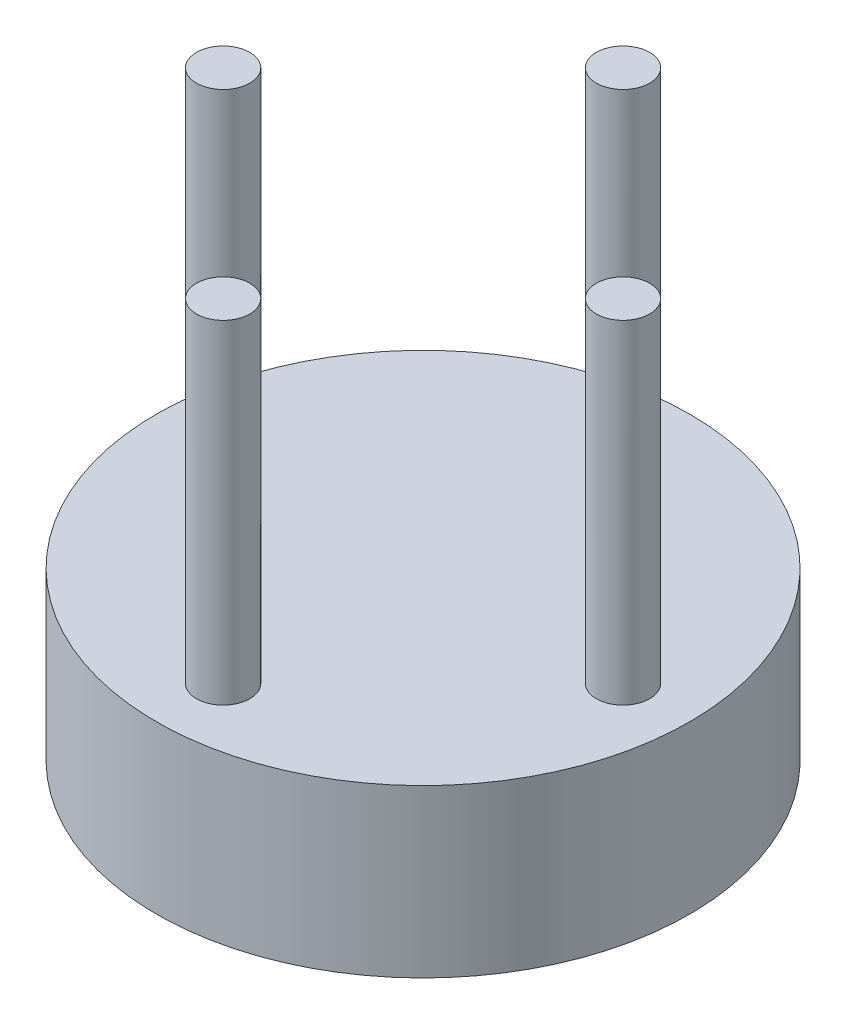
from build123d import *

# Parameters (mm, degrees)
ESQUISSE2_R                  = 4
BOSS_EXTRU_1_DEPTH           = 50
R_P_TITION_CIRCULAIRE1_COUNT = 4


with BuildPart() as part:
    # Esquisse1 → Base-R_volution (revolve)
    with BuildSketch(Plane.XY, mode=Mode.PRIVATE) as base_r_volution_sk:
        Polygon((0, 5), (-27.5, 5), (-27.5, 0), (-32.5, 0), (-32.5, 5), (-40, 5), (-40, 30), (0, 30), align=None)
    revolve(base_r_volution_sk.sketch.rotate(Axis((0, 0, 0), (0, 1, 0)), 270), axis=Axis((0, 0, 0), (0, 1, 0)))

    # Esquisse2 → Boss.-Extru.1 (add)
    with BuildSketch(Plane(origin=(0, 30, 0), x_dir=(-1, 0, 0), z_dir=(0, 1, 0))):
        with Locations(Location((-30, 0, 0), (0, 0, 270))):
            Circle(ESQUISSE2_R)
    boss_extru_1 = extrude(amount=BOSS_EXTRU_1_DEPTH)

    # R_p_tition circulaire1: Boss.-Extru.1 ×4 about axis
    r_p_tition_circulaire1_axis = Axis((0, 0, 0), (0, 1, 0))
    for i in range(1, R_P_TITION_CIRCULAIRE1_COUNT):
        add(boss_extru_1.rotate(r_p_tition_circulaire1_axis, i * 360 / R_P_TITION_CIRCULAIRE1_COUNT))


solid = part.part
